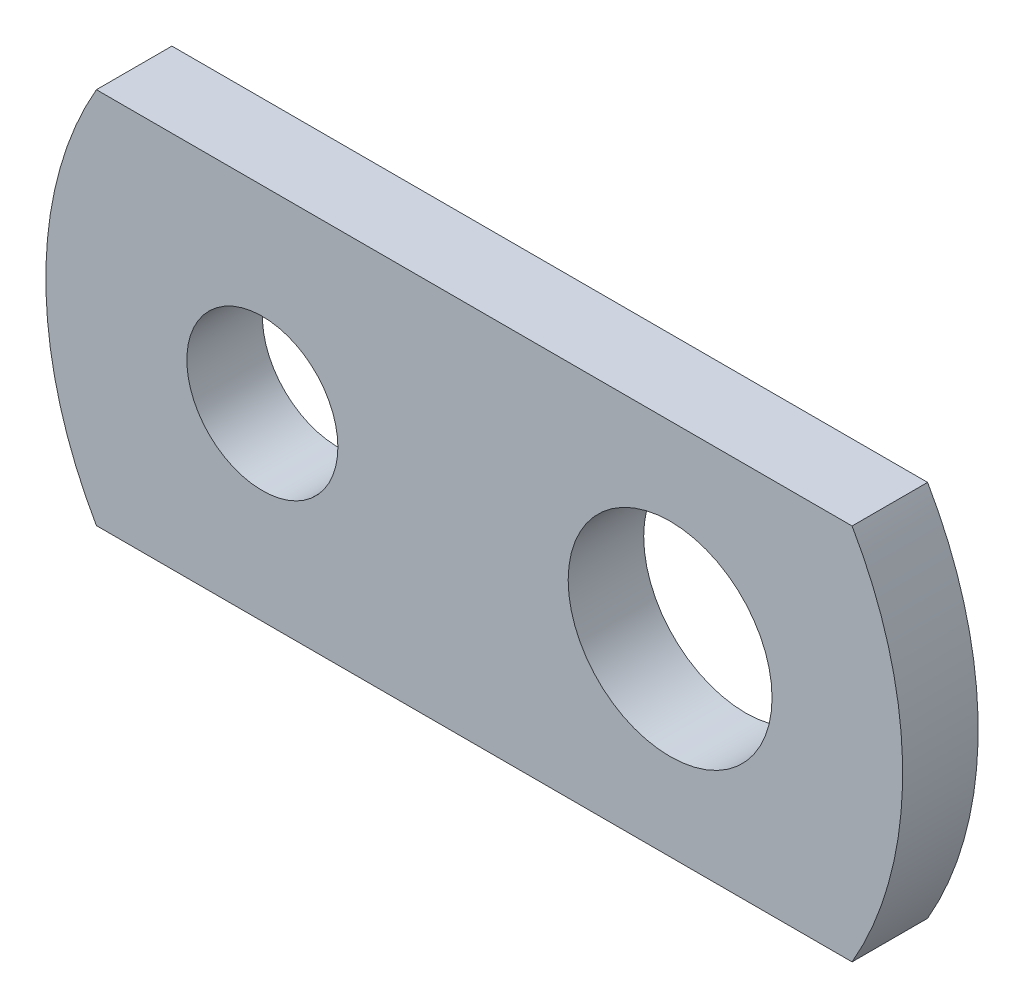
from build123d import *

# Parameters (mm, degrees)
ESQUISSE1_R      = 13.5
ESQUISSE1_R_2    = 10
EXTRUSION1_DEPTH = 10


with BuildPart() as part:
    # Esquisse1 → Extrusion1 (new body)
    with BuildSketch(Plane.XY):
        with BuildLine():
            Line((6.698729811, 0), (106.776579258, 0))
            ThreePointArc((106.776579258, 0), (113.475309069, -25), (106.776579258, -50))
            Line((106.776579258, -50), (6.698729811, -50))
            ThreePointArc((6.698729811, -50), (0, -25), (6.698729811, 0))
        make_face()
        with Locations((82.677228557, -25)):
            Circle(ESQUISSE1_R, mode=Mode.SUBTRACT)
        with Locations((28.677228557, -25)):
            Circle(ESQUISSE1_R_2, mode=Mode.SUBTRACT)
    extrude(amount=EXTRUSION1_DEPTH)


solid = part.part
